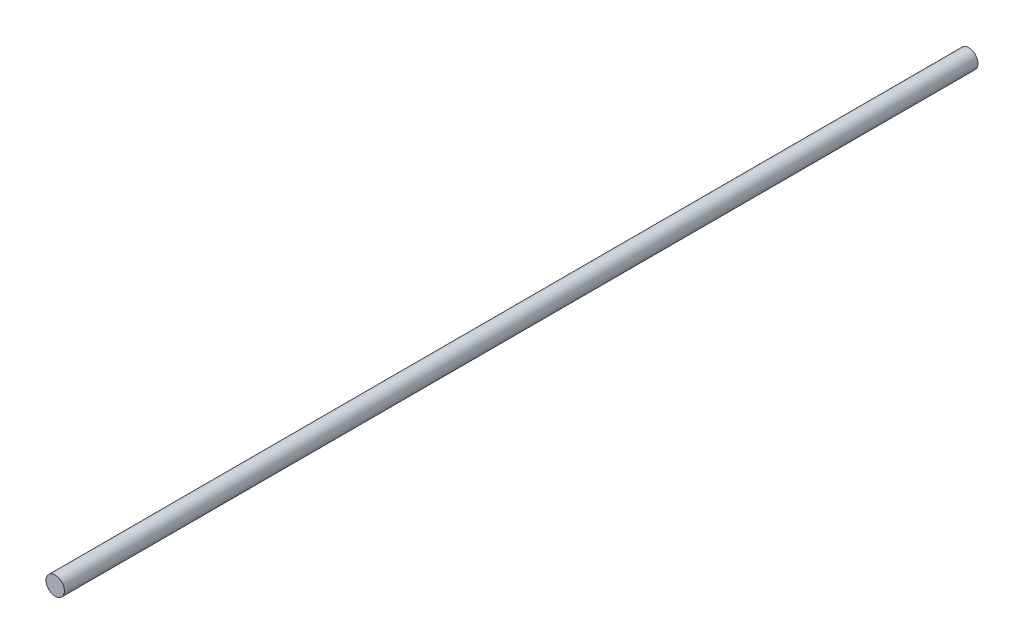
ISO-10303-21;
HEADER;
FILE_DESCRIPTION(('STEP AP214'),'2;1');
FILE_NAME('part.step','',(''),(''),'','','');
FILE_SCHEMA(('AUTOMOTIVE_DESIGN { 1 0 10303 214 1 1 1 1 }'));
ENDSEC;
DATA;
#1=APPLICATION_CONTEXT('core data for automotive mechanical design processes');
#2=APPLICATION_PROTOCOL_DEFINITION('international standard','automotive_design',2000,#1);
#3=PRODUCT_CONTEXT('',#1,'mechanical');
#4=PRODUCT('Part','Part','',(#3));
#5=PRODUCT_RELATED_PRODUCT_CATEGORY('part','',(#4));
#6=PRODUCT_DEFINITION_FORMATION('','',#4);
#7=PRODUCT_DEFINITION_CONTEXT('part definition',#1,'design');
#8=PRODUCT_DEFINITION('design','',#6,#7);
#9=PRODUCT_DEFINITION_SHAPE('','',#8);
#10=(LENGTH_UNIT() NAMED_UNIT(*) SI_UNIT(.MILLI.,.METRE.));
#11=(NAMED_UNIT(*) PLANE_ANGLE_UNIT() SI_UNIT($,.RADIAN.));
#12=(NAMED_UNIT(*) SI_UNIT($,.STERADIAN.) SOLID_ANGLE_UNIT());
#13=UNCERTAINTY_MEASURE_WITH_UNIT(LENGTH_MEASURE(1.E-05),#10,'distance_accuracy_value','');
#14=(GEOMETRIC_REPRESENTATION_CONTEXT(3) GLOBAL_UNCERTAINTY_ASSIGNED_CONTEXT((#13)) GLOBAL_UNIT_ASSIGNED_CONTEXT((#10,
#11,#12)) REPRESENTATION_CONTEXT('',''));
#15=CARTESIAN_POINT('',(0.,0.,0.));
#16=DIRECTION('',(0.,0.,1.));
#17=DIRECTION('',(1.,0.,0.));
#18=AXIS2_PLACEMENT_3D('',#15,#16,#17);
#19=CARTESIAN_POINT('',(0.,0.,97.));
#20=DIRECTION('',(0.,0.,-1.));
#21=DIRECTION('',(-1.,0.,0.));
#22=AXIS2_PLACEMENT_3D('',#19,#20,#21);
#23=CYLINDRICAL_SURFACE('',#22,0.9779);
#24=CARTESIAN_POINT('',(0.,0.,97.));
#25=DIRECTION('',(0.,0.,1.));
#26=DIRECTION('',(1.,0.,0.));
#27=AXIS2_PLACEMENT_3D('',#24,#25,#26);
#28=CIRCLE('',#27,0.9779);
#29=CARTESIAN_POINT('',(-0.9779,0.,97.));
#30=VERTEX_POINT('',#29);
#31=EDGE_CURVE('E10',#30,#30,#28,.T.);
#32=CARTESIAN_POINT('',(0.,0.,0.));
#33=DIRECTION('',(0.,0.,1.));
#34=DIRECTION('',(1.,0.,0.));
#35=AXIS2_PLACEMENT_3D('',#32,#33,#34);
#36=CIRCLE('',#35,0.9779);
#37=CARTESIAN_POINT('',(-0.9779,0.,0.));
#38=VERTEX_POINT('',#37);
#39=EDGE_CURVE('E46',#38,#38,#36,.T.);
#40=CARTESIAN_POINT('',(-0.9779,0.,97.));
#41=CARTESIAN_POINT('',(-0.9779,0.,95.9895833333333));
#42=CARTESIAN_POINT('',(-0.9779,0.,94.9791666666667));
#43=CARTESIAN_POINT('',(-0.9779,0.,92.9583333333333));
#44=CARTESIAN_POINT('',(-0.9779,0.,91.9479166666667));
#45=CARTESIAN_POINT('',(-0.9779,0.,89.9270833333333));
#46=CARTESIAN_POINT('',(-0.9779,0.,88.9166666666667));
#47=CARTESIAN_POINT('',(-0.9779,0.,86.8958333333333));
#48=CARTESIAN_POINT('',(-0.9779,0.,85.8854166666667));
#49=CARTESIAN_POINT('',(-0.9779,0.,83.8645833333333));
#50=CARTESIAN_POINT('',(-0.9779,0.,82.8541666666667));
#51=CARTESIAN_POINT('',(-0.9779,0.,80.8333333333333));
#52=CARTESIAN_POINT('',(-0.9779,0.,79.8229166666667));
#53=CARTESIAN_POINT('',(-0.9779,0.,77.8020833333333));
#54=CARTESIAN_POINT('',(-0.9779,0.,76.7916666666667));
#55=CARTESIAN_POINT('',(-0.9779,0.,74.7708333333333));
#56=CARTESIAN_POINT('',(-0.9779,0.,73.7604166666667));
#57=CARTESIAN_POINT('',(-0.9779,0.,71.7395833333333));
#58=CARTESIAN_POINT('',(-0.9779,0.,70.7291666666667));
#59=CARTESIAN_POINT('',(-0.9779,0.,68.7083333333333));
#60=CARTESIAN_POINT('',(-0.9779,0.,67.6979166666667));
#61=CARTESIAN_POINT('',(-0.9779,0.,65.6770833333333));
#62=CARTESIAN_POINT('',(-0.9779,0.,64.6666666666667));
#63=CARTESIAN_POINT('',(-0.9779,0.,62.6458333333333));
#64=CARTESIAN_POINT('',(-0.9779,0.,61.6354166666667));
#65=CARTESIAN_POINT('',(-0.9779,0.,59.6145833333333));
#66=CARTESIAN_POINT('',(-0.9779,0.,58.6041666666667));
#67=CARTESIAN_POINT('',(-0.9779,0.,56.5833333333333));
#68=CARTESIAN_POINT('',(-0.9779,0.,55.5729166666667));
#69=CARTESIAN_POINT('',(-0.9779,0.,53.5520833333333));
#70=CARTESIAN_POINT('',(-0.9779,0.,52.5416666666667));
#71=CARTESIAN_POINT('',(-0.9779,0.,50.5208333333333));
#72=CARTESIAN_POINT('',(-0.9779,0.,49.5104166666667));
#73=CARTESIAN_POINT('',(-0.9779,0.,47.4895833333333));
#74=CARTESIAN_POINT('',(-0.9779,0.,46.4791666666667));
#75=CARTESIAN_POINT('',(-0.9779,0.,44.4583333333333));
#76=CARTESIAN_POINT('',(-0.9779,0.,43.4479166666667));
#77=CARTESIAN_POINT('',(-0.9779,0.,41.4270833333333));
#78=CARTESIAN_POINT('',(-0.9779,0.,40.4166666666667));
#79=CARTESIAN_POINT('',(-0.9779,0.,38.3958333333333));
#80=CARTESIAN_POINT('',(-0.9779,0.,37.3854166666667));
#81=CARTESIAN_POINT('',(-0.9779,0.,35.3645833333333));
#82=CARTESIAN_POINT('',(-0.9779,0.,34.3541666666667));
#83=CARTESIAN_POINT('',(-0.9779,0.,32.3333333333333));
#84=CARTESIAN_POINT('',(-0.9779,0.,31.3229166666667));
#85=CARTESIAN_POINT('',(-0.9779,0.,29.3020833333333));
#86=CARTESIAN_POINT('',(-0.9779,0.,28.2916666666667));
#87=CARTESIAN_POINT('',(-0.9779,0.,26.2708333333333));
#88=CARTESIAN_POINT('',(-0.9779,0.,25.2604166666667));
#89=CARTESIAN_POINT('',(-0.9779,0.,23.2395833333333));
#90=CARTESIAN_POINT('',(-0.9779,0.,22.2291666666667));
#91=CARTESIAN_POINT('',(-0.9779,0.,20.2083333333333));
#92=CARTESIAN_POINT('',(-0.9779,0.,19.1979166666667));
#93=CARTESIAN_POINT('',(-0.9779,0.,17.1770833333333));
#94=CARTESIAN_POINT('',(-0.9779,0.,16.1666666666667));
#95=CARTESIAN_POINT('',(-0.9779,0.,14.1458333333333));
#96=CARTESIAN_POINT('',(-0.9779,0.,13.1354166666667));
#97=CARTESIAN_POINT('',(-0.9779,0.,11.1145833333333));
#98=CARTESIAN_POINT('',(-0.9779,0.,10.1041666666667));
#99=CARTESIAN_POINT('',(-0.9779,0.,8.08333333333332));
#100=CARTESIAN_POINT('',(-0.9779,0.,7.07291666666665));
#101=CARTESIAN_POINT('',(-0.9779,0.,5.05208333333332));
#102=CARTESIAN_POINT('',(-0.9779,0.,4.04166666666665));
#103=CARTESIAN_POINT('',(-0.9779,0.,2.02083333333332));
#104=CARTESIAN_POINT('',(-0.9779,0.,1.01041666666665));
#105=CARTESIAN_POINT('',(-0.9779,0.,0.));
#106=B_SPLINE_CURVE_WITH_KNOTS('',3,(#40,#41,#42,#43,#44,#45,#46,#47,#48,#49,#50,#51,#52,#53,
#54,#55,#56,#57,#58,#59,#60,#61,#62,#63,#64,#65,#66,#67,#68,#69,#70,#71,#72,#73,#74,#75,#76,#77,
#78,#79,#80,#81,#82,#83,#84,#85,#86,#87,#88,#89,#90,#91,#92,#93,#94,#95,#96,#97,#98,#99,#100,
#101,#102,#103,#104,#105),.UNSPECIFIED.,.F.,.F.,(4,2,2,2,2,2,2,2,2,2,2,2,2,2,2,2,2,2,2,2,2,2,2,
2,2,2,2,2,2,2,2,2,4),(0.,3.03125,6.0625,9.09375,12.125,15.15625,18.1875,21.21875,24.25,27.28125,
30.3125,33.34375,36.375,39.40625,42.4375,45.46875,48.5,51.53125,54.5625,57.59375,60.625,
63.65625,66.6875,69.71875,72.75,75.78125,78.8125,81.84375,84.875,87.90625,90.9375,93.96875,97.),.UNSPECIFIED.);
#107=EDGE_CURVE('BSEAM43',#30,#38,#106,.T.);
#108=ORIENTED_EDGE('',*,*,#31,.F.);
#109=ORIENTED_EDGE('',*,*,#39,.T.);
#110=ORIENTED_EDGE('',*,*,#107,.T.);
#111=ORIENTED_EDGE('',*,*,#107,.F.);
#112=EDGE_LOOP('',(#108,#110,#109,#111));
#113=FACE_BOUND('',#112,.T.);
#114=ADVANCED_FACE('F43',(#113),#23,.T.);
#115=CARTESIAN_POINT('',(0.,0.,97.));
#116=DIRECTION('',(0.,0.,1.));
#117=DIRECTION('',(1.,0.,0.));
#118=AXIS2_PLACEMENT_3D('',#115,#116,#117);
#119=PLANE('',#118);
#120=ORIENTED_EDGE('',*,*,#31,.T.);
#121=EDGE_LOOP('',(#120));
#122=FACE_BOUND('',#121,.T.);
#123=ADVANCED_FACE('F60',(#122),#119,.T.);
#124=CARTESIAN_POINT('',(0.,0.,0.));
#125=DIRECTION('',(0.,0.,1.));
#126=DIRECTION('',(1.,0.,0.));
#127=AXIS2_PLACEMENT_3D('',#124,#125,#126);
#128=PLANE('',#127);
#129=ORIENTED_EDGE('',*,*,#39,.F.);
#130=EDGE_LOOP('',(#129));
#131=FACE_BOUND('',#130,.T.);
#132=ADVANCED_FACE('F58',(#131),#128,.F.);
#133=CLOSED_SHELL('',(#114,#123,#132));
#134=MANIFOLD_SOLID_BREP('B2',#133);
#135=ADVANCED_BREP_SHAPE_REPRESENTATION('',(#18,#134),#14);
#136=SHAPE_DEFINITION_REPRESENTATION(#9,#135);
ENDSEC;
END-ISO-10303-21;
